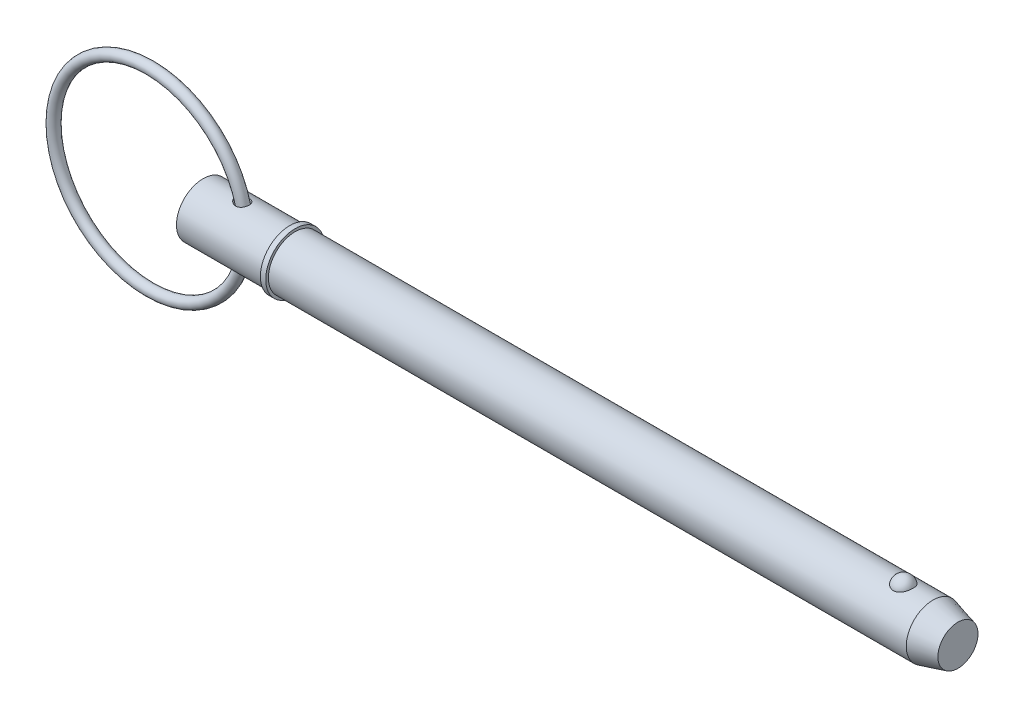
ISO-10303-21;
HEADER;
FILE_DESCRIPTION(('STEP AP214'),'2;1');
FILE_NAME('part.step','',(''),(''),'','','');
FILE_SCHEMA(('AUTOMOTIVE_DESIGN { 1 0 10303 214 1 1 1 1 }'));
ENDSEC;
DATA;
#1=APPLICATION_CONTEXT('core data for automotive mechanical design processes');
#2=APPLICATION_PROTOCOL_DEFINITION('international standard','automotive_design',2000,#1);
#3=PRODUCT_CONTEXT('',#1,'mechanical');
#4=PRODUCT('Part','Part','',(#3));
#5=PRODUCT_RELATED_PRODUCT_CATEGORY('part','',(#4));
#6=PRODUCT_DEFINITION_FORMATION('','',#4);
#7=PRODUCT_DEFINITION_CONTEXT('part definition',#1,'design');
#8=PRODUCT_DEFINITION('design','',#6,#7);
#9=PRODUCT_DEFINITION_SHAPE('','',#8);
#10=(LENGTH_UNIT() NAMED_UNIT(*) SI_UNIT(.MILLI.,.METRE.));
#11=(NAMED_UNIT(*) PLANE_ANGLE_UNIT() SI_UNIT($,.RADIAN.));
#12=(NAMED_UNIT(*) SI_UNIT($,.STERADIAN.) SOLID_ANGLE_UNIT());
#13=UNCERTAINTY_MEASURE_WITH_UNIT(LENGTH_MEASURE(1.E-05),#10,'distance_accuracy_value','');
#14=(GEOMETRIC_REPRESENTATION_CONTEXT(3) GLOBAL_UNCERTAINTY_ASSIGNED_CONTEXT((#13)) GLOBAL_UNIT_ASSIGNED_CONTEXT((#10,
#11,#12)) REPRESENTATION_CONTEXT('',''));
#15=CARTESIAN_POINT('',(0.,0.,0.));
#16=DIRECTION('',(0.,0.,1.));
#17=DIRECTION('',(1.,0.,0.));
#18=AXIS2_PLACEMENT_3D('',#15,#16,#17);
#19=CARTESIAN_POINT('',(-15.855506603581,0.,0.));
#20=DIRECTION('',(0.,0.,1.));
#21=DIRECTION('',(1.,0.,0.));
#22=AXIS2_PLACEMENT_3D('',#19,#20,#21);
#23=TOROIDAL_SURFACE('',#22,28.575,1.588);
#24=CARTESIAN_POINT('',(14.307493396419,0.,0.));
#25=VERTEX_POINT('',#24);
#26=VERTEX_LOOP('',#25);
#27=FACE_BOUND('',#26,.T.);
#28=ADVANCED_FACE('P0_F12',(#27),#23,.T.);
#29=CLOSED_SHELL('',(#28));
#30=MANIFOLD_SOLID_BREP('P0_B1',#29);
#31=CARTESIAN_POINT('',(0.,0.,0.));
#32=DIRECTION('',(1.,0.,0.));
#33=DIRECTION('',(0.,0.,-1.));
#34=AXIS2_PLACEMENT_3D('',#31,#32,#33);
#35=CYLINDRICAL_SURFACE('',#34,7.94);
#36=CARTESIAN_POINT('',(9.9064878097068,7.8609270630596,-1.11777712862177));
#37=CARTESIAN_POINT('',(9.98046148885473,7.84701054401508,-1.21564239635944));
#38=CARTESIAN_POINT('',(10.0632949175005,7.83217804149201,-1.30680329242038));
#39=CARTESIAN_POINT('',(10.243327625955,7.80247884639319,-1.47382688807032));
#40=CARTESIAN_POINT('',(10.3405572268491,7.78761214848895,-1.54965647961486));
#41=CARTESIAN_POINT('',(10.5460150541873,7.75960959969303,-1.6842723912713));
#42=CARTESIAN_POINT('',(10.654212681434,7.74646915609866,-1.74310445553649));
#43=CARTESIAN_POINT('',(10.8789333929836,7.72340979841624,-1.84259563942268));
#44=CARTESIAN_POINT('',(10.9954527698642,7.71348946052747,-1.88326279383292));
#45=CARTESIAN_POINT('',(11.2371543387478,7.69793327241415,-1.94589519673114));
#46=CARTESIAN_POINT('',(11.3624861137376,7.69242163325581,-1.96732022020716));
#47=CARTESIAN_POINT('',(11.6151110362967,7.68708151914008,-1.98809161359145));
#48=CARTESIAN_POINT('',(11.7424035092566,7.68725113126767,-1.98744541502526));
#49=CARTESIAN_POINT('',(11.9871377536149,7.69329740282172,-1.96389977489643));
#50=CARTESIAN_POINT('',(12.1047148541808,7.69883374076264,-1.94232728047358));
#51=CARTESIAN_POINT('',(12.3339179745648,7.7145667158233,-1.87886184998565));
#52=CARTESIAN_POINT('',(12.4455463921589,7.72476145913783,-1.83697717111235));
#53=CARTESIAN_POINT('',(12.6521036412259,7.74778151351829,-1.73721211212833));
#54=CARTESIAN_POINT('',(12.7476463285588,7.76039274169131,-1.68054854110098));
#55=CARTESIAN_POINT('',(12.9274536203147,7.78715828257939,-1.55179691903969));
#56=CARTESIAN_POINT('',(13.0117191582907,7.80131246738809,-1.47971014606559));
#57=CARTESIAN_POINT('',(13.16544092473,7.82932755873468,-1.32341211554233));
#58=CARTESIAN_POINT('',(13.2351086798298,7.84318958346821,-1.23940873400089));
#59=CARTESIAN_POINT('',(13.3595610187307,7.86933512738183,-1.06080152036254));
#60=CARTESIAN_POINT('',(13.4143450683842,7.88161858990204,-0.966197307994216));
#61=CARTESIAN_POINT('',(13.5082288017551,7.90340571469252,-0.767990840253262));
#62=CARTESIAN_POINT('',(13.5471601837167,7.91287927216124,-0.664305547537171));
#63=CARTESIAN_POINT('',(13.6076213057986,7.92785679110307,-0.451705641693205));
#64=CARTESIAN_POINT('',(13.6291504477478,7.93336061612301,-0.3427908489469));
#65=CARTESIAN_POINT('',(13.6544025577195,7.93983472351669,-0.122042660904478));
#66=CARTESIAN_POINT('',(13.6580055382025,7.94077445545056,-0.0101946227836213));
#67=CARTESIAN_POINT('',(13.6469977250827,7.93793630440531,0.212542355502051));
#68=CARTESIAN_POINT('',(13.6323866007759,7.93415833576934,0.323431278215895));
#69=CARTESIAN_POINT('',(13.5852649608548,7.92228583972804,0.541194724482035));
#70=CARTESIAN_POINT('',(13.5527398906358,7.91418780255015,0.648065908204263));
#71=CARTESIAN_POINT('',(13.4705326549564,7.8945509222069,0.854658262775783));
#72=CARTESIAN_POINT('',(13.4208502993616,7.88301204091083,0.954379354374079));
#73=CARTESIAN_POINT('',(13.3056021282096,7.85778224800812,1.14366619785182));
#74=CARTESIAN_POINT('',(13.2400609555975,7.8440946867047,1.23324739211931));
#75=CARTESIAN_POINT('',(13.0946981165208,7.8160855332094,1.39984119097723));
#76=CARTESIAN_POINT('',(13.0148777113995,7.80176399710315,1.47685490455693));
#77=CARTESIAN_POINT('',(12.8438529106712,7.774237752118,1.6154855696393));
#78=CARTESIAN_POINT('',(12.7527554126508,7.76102428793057,1.67723263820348));
#79=CARTESIAN_POINT('',(12.5611987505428,7.73705789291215,1.78453696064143));
#80=CARTESIAN_POINT('',(12.4607407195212,7.72630466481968,1.83009617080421));
#81=CARTESIAN_POINT('',(12.2541997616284,7.70849465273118,1.90371822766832));
#82=CARTESIAN_POINT('',(12.1481665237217,7.7014098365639,1.93191408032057));
#83=CARTESIAN_POINT('',(11.9327851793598,7.69148605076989,1.97105353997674));
#84=CARTESIAN_POINT('',(11.8234367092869,7.68864754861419,1.98199524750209));
#85=CARTESIAN_POINT('',(11.6016024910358,7.68735890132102,1.98698770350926));
#86=CARTESIAN_POINT('',(11.4891069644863,7.68902083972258,1.98060702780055));
#87=CARTESIAN_POINT('',(11.2665484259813,7.6966276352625,1.95083303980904));
#88=CARTESIAN_POINT('',(11.1564861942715,7.70257384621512,1.92743434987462));
#89=CARTESIAN_POINT('',(10.9339966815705,7.71853798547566,1.86251478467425));
#90=CARTESIAN_POINT('',(10.8219140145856,7.72880438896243,1.81987394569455));
#91=CARTESIAN_POINT('',(10.6060441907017,7.75216432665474,1.7176403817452));
#92=CARTESIAN_POINT('',(10.5022611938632,7.76525926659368,1.65803922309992));
#93=CARTESIAN_POINT('',(10.3000447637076,7.79362794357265,1.51929354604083));
#94=CARTESIAN_POINT('',(10.2022480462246,7.80898310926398,1.4392327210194));
#95=CARTESIAN_POINT('',(10.0221668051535,7.83939672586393,1.26310118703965));
#96=CARTESIAN_POINT('',(9.93988168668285,7.85445518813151,1.16703109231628));
#97=CARTESIAN_POINT('',(9.79729823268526,7.88178950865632,0.964874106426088));
#98=CARTESIAN_POINT('',(9.73627994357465,7.89414970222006,0.859310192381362));
#99=CARTESIAN_POINT('',(9.63554001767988,7.91508909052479,0.638143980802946));
#100=CARTESIAN_POINT('',(9.59578986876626,7.92367334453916,0.52255536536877));
#101=CARTESIAN_POINT('',(9.54388714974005,7.93499161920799,0.300466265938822));
#102=CARTESIAN_POINT('',(9.52888458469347,7.93832727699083,0.194660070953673));
#103=CARTESIAN_POINT('',(9.51823078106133,7.94068976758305,-0.0179747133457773));
#104=CARTESIAN_POINT('',(9.52257317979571,7.93971801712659,-0.124802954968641));
#105=CARTESIAN_POINT('',(9.54911264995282,7.93386114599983,-0.326814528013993));
#106=CARTESIAN_POINT('',(9.56976509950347,7.92931471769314,-0.422217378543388));
#107=CARTESIAN_POINT('',(9.62591284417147,7.91721462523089,-0.608271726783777));
#108=CARTESIAN_POINT('',(9.66139801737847,7.90966301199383,-0.698926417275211));
#109=CARTESIAN_POINT('',(9.7317197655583,7.89515389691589,-0.844763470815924));
#110=CARTESIAN_POINT('',(9.76292633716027,7.88881879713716,-0.90180107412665));
#111=CARTESIAN_POINT('',(9.83075962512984,7.87538342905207,-1.01244242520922));
#112=CARTESIAN_POINT('',(9.86738597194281,7.86828321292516,-1.06604640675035));
#113=CARTESIAN_POINT('',(9.9064878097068,7.8609270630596,-1.11777712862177));
#114=B_SPLINE_CURVE_WITH_KNOTS('',3,(#36,#37,#38,#39,#40,#41,#42,#43,#44,#45,#46,#47,#48,#49,
#50,#51,#52,#53,#54,#55,#56,#57,#58,#59,#60,#61,#62,#63,#64,#65,#66,#67,#68,#69,#70,#71,#72,#73,
#74,#75,#76,#77,#78,#79,#80,#81,#82,#83,#84,#85,#86,#87,#88,#89,#90,#91,#92,#93,#94,#95,#96,#97,
#98,#99,#100,#101,#102,#103,#104,#105,#106,#107,#108,#109,#110,#111,#112,#113),.UNSPECIFIED.,
.T.,.F.,(4,2,2,2,2,2,2,2,2,2,2,2,2,2,2,2,2,2,2,2,2,2,2,2,2,2,2,2,2,2,2,2,2,2,2,2,2,2,4),(0.,
0.370138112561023,0.741067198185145,1.11098852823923,1.48074607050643,1.86058657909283,
2.24029919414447,2.59740885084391,2.95437345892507,3.2881332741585,3.62186544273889,
3.95036374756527,4.27887384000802,4.61078596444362,4.94270949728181,5.27685177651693,
5.61100012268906,5.94542035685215,6.27984429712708,6.61375187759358,6.94762997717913,
7.27855592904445,7.60944187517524,7.93776058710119,8.26611544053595,8.60272268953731,
8.93943635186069,9.29895306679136,9.65864886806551,10.0387340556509,10.4188046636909,
10.7843533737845,11.1494107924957,11.4683925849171,11.7872694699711,12.0791172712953,
12.3707662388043,12.5664313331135,12.7620830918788),.UNSPECIFIED.);
#115=CARTESIAN_POINT('',(9.9064878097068,7.8609270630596,-1.11777712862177));
#116=VERTEX_POINT('',#115);
#117=EDGE_CURVE('P1_E42',#116,#116,#114,.T.);
#118=ORIENTED_EDGE('',*,*,#117,.T.);
#119=EDGE_LOOP('',(#118));
#120=FACE_BOUND('',#119,.T.);
#121=CARTESIAN_POINT('',(0.,0.,0.));
#122=DIRECTION('',(1.,0.,0.));
#123=DIRECTION('',(0.,0.,-1.));
#124=AXIS2_PLACEMENT_3D('',#121,#122,#123);
#125=CIRCLE('',#124,7.94);
#126=CARTESIAN_POINT('',(0.,0.,-7.94));
#127=VERTEX_POINT('',#126);
#128=EDGE_CURVE('P1_E9',#127,#127,#125,.T.);
#129=ORIENTED_EDGE('',*,*,#128,.T.);
#130=EDGE_LOOP('',(#129));
#131=FACE_BOUND('',#130,.T.);
#132=CARTESIAN_POINT('',(25.722,0.,0.));
#133=DIRECTION('',(1.,0.,0.));
#134=DIRECTION('',(0.,0.,-1.));
#135=AXIS2_PLACEMENT_3D('',#132,#133,#134);
#136=CIRCLE('',#135,7.94);
#137=CARTESIAN_POINT('',(25.722,0.,-7.94));
#138=VERTEX_POINT('',#137);
#139=EDGE_CURVE('P1_E25',#138,#138,#136,.T.);
#140=ORIENTED_EDGE('',*,*,#139,.F.);
#141=EDGE_LOOP('',(#140));
#142=FACE_BOUND('',#141,.T.);
#143=CARTESIAN_POINT('',(9.9064878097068,-7.8609270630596,-1.11777712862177));
#144=CARTESIAN_POINT('',(9.84378768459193,-7.87272256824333,-1.03482250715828));
#145=CARTESIAN_POINT('',(9.7874122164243,-7.88386682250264,-0.947002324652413));
#146=CARTESIAN_POINT('',(9.68947008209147,-7.90377389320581,-0.763202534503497));
#147=CARTESIAN_POINT('',(9.64789384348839,-7.91253824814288,-0.667228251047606));
#148=CARTESIAN_POINT('',(9.58141396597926,-7.92676779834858,-0.46889851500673));
#149=CARTESIAN_POINT('',(9.55658638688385,-7.93221793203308,-0.36651622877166));
#150=CARTESIAN_POINT('',(9.525398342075,-7.9390896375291,-0.158837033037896));
#151=CARTESIAN_POINT('',(9.51903196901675,-7.94051249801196,-0.0535410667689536));
#152=CARTESIAN_POINT('',(9.5249639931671,-7.93919670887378,0.149856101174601));
#153=CARTESIAN_POINT('',(9.53611757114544,-7.9367132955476,0.24799461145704));
#154=CARTESIAN_POINT('',(9.57435037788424,-7.92833496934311,0.44094918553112));
#155=CARTESIAN_POINT('',(9.60143086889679,-7.92243978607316,0.535764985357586));
#156=CARTESIAN_POINT('',(9.67027872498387,-7.90782830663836,0.720026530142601));
#157=CARTESIAN_POINT('',(9.71210005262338,-7.89910165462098,0.809451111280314));
#158=CARTESIAN_POINT('',(9.80864905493,-7.87966534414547,0.980775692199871));
#159=CARTESIAN_POINT('',(9.86338092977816,-7.86895504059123,1.06267323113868));
#160=CARTESIAN_POINT('',(9.99009906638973,-7.84531573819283,1.22559225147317));
#161=CARTESIAN_POINT('',(10.0632770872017,-7.8322718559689,1.30566871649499));
#162=CARTESIAN_POINT('',(10.2208237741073,-7.80611237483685,1.45392159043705));
#163=CARTESIAN_POINT('',(10.3051986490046,-7.79299674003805,1.52209134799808));
#164=CARTESIAN_POINT('',(10.4935539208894,-7.76638841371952,1.65280871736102));
#165=CARTESIAN_POINT('',(10.5986730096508,-7.75303312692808,1.71374951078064));
#166=CARTESIAN_POINT('',(10.8175805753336,-7.72920597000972,1.81820073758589));
#167=CARTESIAN_POINT('',(10.9313721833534,-7.71873514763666,1.86170483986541));
#168=CARTESIAN_POINT('',(11.1696833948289,-7.70161777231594,1.93133079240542));
#169=CARTESIAN_POINT('',(11.2944525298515,-7.69514907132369,1.95665138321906));
#170=CARTESIAN_POINT('',(11.5466607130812,-7.6877908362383,1.98537345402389));
#171=CARTESIAN_POINT('',(11.6740986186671,-7.68689896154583,1.98878412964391));
#172=CARTESIAN_POINT('',(11.9206005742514,-7.690938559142,1.97309854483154));
#173=CARTESIAN_POINT('',(12.0397453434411,-7.69555832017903,1.95520713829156));
#174=CARTESIAN_POINT('',(12.2727177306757,-7.70968728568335,1.89872693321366));
#175=CARTESIAN_POINT('',(12.3865475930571,-7.71919440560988,1.86014695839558));
#176=CARTESIAN_POINT('',(12.5975118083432,-7.74115679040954,1.76641559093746));
#177=CARTESIAN_POINT('',(12.6952552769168,-7.75336701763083,1.71257254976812));
#178=CARTESIAN_POINT('',(12.8798510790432,-7.77962828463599,1.58901145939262));
#179=CARTESIAN_POINT('',(12.9667044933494,-7.79367914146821,1.51929498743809));
#180=CARTESIAN_POINT('',(13.1254818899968,-7.82172079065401,1.36751778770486));
#181=CARTESIAN_POINT('',(13.1976693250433,-7.83570718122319,1.28573131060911));
#182=CARTESIAN_POINT('',(13.3274495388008,-7.86236718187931,1.11111271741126));
#183=CARTESIAN_POINT('',(13.3850418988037,-7.87504075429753,1.01828028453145));
#184=CARTESIAN_POINT('',(13.4847470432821,-7.89782512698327,0.823214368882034));
#185=CARTESIAN_POINT('',(13.5267056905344,-7.90791011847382,0.72089908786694));
#186=CARTESIAN_POINT('',(13.5933891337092,-7.92427335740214,0.510509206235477));
#187=CARTESIAN_POINT('',(13.6181132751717,-7.9305514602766,0.40243438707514));
#188=CARTESIAN_POINT('',(13.6498843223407,-7.93866355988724,0.182728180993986));
#189=CARTESIAN_POINT('',(13.6567982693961,-7.94046412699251,0.0710763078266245));
#190=CARTESIAN_POINT('',(13.6524060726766,-7.93933046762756,-0.151845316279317));
#191=CARTESIAN_POINT('',(13.6410996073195,-7.93639615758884,-0.263115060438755));
#192=CARTESIAN_POINT('',(13.6005023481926,-7.92610202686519,-0.482238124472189));
#193=CARTESIAN_POINT('',(13.571192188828,-7.91873744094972,-0.590087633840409));
#194=CARTESIAN_POINT('',(13.495246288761,-7.90037565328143,-0.799178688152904));
#195=CARTESIAN_POINT('',(13.4486102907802,-7.88937839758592,-0.900420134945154));
#196=CARTESIAN_POINT('',(13.3391817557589,-7.86497175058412,-1.09328280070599));
#197=CARTESIAN_POINT('',(13.2764083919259,-7.85156522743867,-1.18491525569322));
#198=CARTESIAN_POINT('',(13.1362355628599,-7.8238261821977,-1.35604994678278));
#199=CARTESIAN_POINT('',(13.0588372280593,-7.80949373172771,-1.43555311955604));
#200=CARTESIAN_POINT('',(12.8921392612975,-7.78164292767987,-1.57955181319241));
#201=CARTESIAN_POINT('',(12.8029410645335,-7.76811892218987,-1.64416363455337));
#202=CARTESIAN_POINT('',(12.6146622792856,-7.74328422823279,-1.75742016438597));
#203=CARTESIAN_POINT('',(12.5155829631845,-7.73197325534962,-1.80606692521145));
#204=CARTESIAN_POINT('',(12.31135301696,-7.71289290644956,-1.88588502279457));
#205=CARTESIAN_POINT('',(12.2062651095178,-7.70509254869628,-1.91720981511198));
#206=CARTESIAN_POINT('',(11.9922253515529,-7.69365188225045,-1.96261878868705));
#207=CARTESIAN_POINT('',(11.8832731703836,-7.69001193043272,-1.97670149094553));
#208=CARTESIAN_POINT('',(11.662174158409,-7.6871142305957,-1.98794112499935));
#209=CARTESIAN_POINT('',(11.5500082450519,-7.6879499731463,-1.98473694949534));
#210=CARTESIAN_POINT('',(11.3276038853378,-7.69396349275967,-1.96129119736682));
#211=CARTESIAN_POINT('',(11.2173659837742,-7.6991424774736,-1.94104488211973));
#212=CARTESIAN_POINT('',(10.9943151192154,-7.71363470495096,-1.8826578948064));
#213=CARTESIAN_POINT('',(10.8818004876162,-7.72319478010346,-1.8434396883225));
#214=CARTESIAN_POINT('',(10.6644693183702,-7.74534199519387,-1.74804607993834));
#215=CARTESIAN_POINT('',(10.5596578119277,-7.75793109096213,-1.69185971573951));
#216=CARTESIAN_POINT('',(10.3538333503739,-7.78563853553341,-1.55958016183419));
#217=CARTESIAN_POINT('',(10.2535123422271,-7.80086820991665,-1.48242881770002));
#218=CARTESIAN_POINT('',(10.0678634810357,-7.83136022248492,-1.31182139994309));
#219=CARTESIAN_POINT('',(9.98252491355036,-7.84662252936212,-1.21837707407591));
#220=CARTESIAN_POINT('',(9.9064878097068,-7.8609270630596,-1.11777712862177));
#221=B_SPLINE_CURVE_WITH_KNOTS('',3,(#143,#144,#145,#146,#147,#148,#149,#150,#151,#152,#153,
#154,#155,#156,#157,#158,#159,#160,#161,#162,#163,#164,#165,#166,#167,#168,#169,#170,#171,#172,
#173,#174,#175,#176,#177,#178,#179,#180,#181,#182,#183,#184,#185,#186,#187,#188,#189,#190,#191,
#192,#193,#194,#195,#196,#197,#198,#199,#200,#201,#202,#203,#204,#205,#206,#207,#208,#209,#210,
#211,#212,#213,#214,#215,#216,#217,#218,#219,#220),.UNSPECIFIED.,.T.,.F.,(4,2,2,2,2,2,2,2,2,2,2,
2,2,2,2,2,2,2,2,2,2,2,2,2,2,2,2,2,2,2,2,2,2,2,2,2,2,2,4),(0.,0.313593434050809,
0.626983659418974,0.941787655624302,1.25649090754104,1.55146990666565,1.84647228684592,
2.14256601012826,2.43875619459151,2.76521830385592,3.09186220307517,3.45696288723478,
3.82219601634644,4.20267276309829,4.58298981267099,4.94277962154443,5.30241610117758,
5.63754619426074,5.9726430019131,6.30104941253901,6.62946524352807,6.96103833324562,
7.29262401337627,7.62667800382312,7.96073789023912,8.29515773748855,8.62958255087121,
8.96361184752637,9.29761533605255,9.62891449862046,9.96017105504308,10.288443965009,
10.616745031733,10.951930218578,11.2872086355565,11.6442788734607,12.0015802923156,
12.3821516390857,12.762449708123),.UNSPECIFIED.);
#222=CARTESIAN_POINT('',(9.9064878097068,-7.8609270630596,-1.11777712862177));
#223=VERTEX_POINT('',#222);
#224=EDGE_CURVE('P1_E17',#223,#223,#221,.T.);
#225=ORIENTED_EDGE('',*,*,#224,.T.);
#226=EDGE_LOOP('',(#225));
#227=FACE_BOUND('',#226,.T.);
#228=ADVANCED_FACE('P1_F13',(#120,#131,#142,#227),#35,.T.);
#229=CARTESIAN_POINT('',(0.,0.,0.));
#230=DIRECTION('',(1.,0.,0.));
#231=DIRECTION('',(0.,0.,-1.));
#232=AXIS2_PLACEMENT_3D('',#229,#230,#231);
#233=CYLINDRICAL_SURFACE('',#232,7.94);
#234=CARTESIAN_POINT('',(216.751879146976,0.,0.));
#235=DIRECTION('',(1.,0.,0.));
#236=DIRECTION('',(0.,0.,-1.));
#237=AXIS2_PLACEMENT_3D('',#234,#235,#236);
#238=CIRCLE('',#237,7.94);
#239=CARTESIAN_POINT('',(216.751879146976,0.,-7.94));
#240=VERTEX_POINT('',#239);
#241=EDGE_CURVE('P1_E99',#240,#240,#238,.T.);
#242=ORIENTED_EDGE('',*,*,#241,.F.);
#243=EDGE_LOOP('',(#242));
#244=FACE_BOUND('',#243,.T.);
#245=CARTESIAN_POINT('',(27.31,0.,0.));
#246=DIRECTION('',(1.,0.,0.));
#247=DIRECTION('',(0.,0.,-1.));
#248=AXIS2_PLACEMENT_3D('',#245,#246,#247);
#249=CIRCLE('',#248,7.94);
#250=CARTESIAN_POINT('',(27.31,0.,-7.94));
#251=VERTEX_POINT('',#250);
#252=EDGE_CURVE('P1_E96',#251,#251,#249,.T.);
#253=ORIENTED_EDGE('',*,*,#252,.T.);
#254=EDGE_LOOP('',(#253));
#255=FACE_BOUND('',#254,.T.);
#256=CARTESIAN_POINT('',(207.944907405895,7.37767842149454,2.93486986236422));
#257=CARTESIAN_POINT('',(207.792749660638,7.3776732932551,2.93487505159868));
#258=CARTESIAN_POINT('',(207.640632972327,7.38258419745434,2.92262454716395));
#259=CARTESIAN_POINT('',(207.340928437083,7.40163229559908,2.87404196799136));
#260=CARTESIAN_POINT('',(207.193339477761,7.41576720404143,2.83771585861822));
#261=CARTESIAN_POINT('',(206.907018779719,7.45161576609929,2.74218769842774));
#262=CARTESIAN_POINT('',(206.768274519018,7.47331841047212,2.68301886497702));
#263=CARTESIAN_POINT('',(206.502882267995,7.52194082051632,2.54350967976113));
#264=CARTESIAN_POINT('',(206.376236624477,7.54886159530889,2.46316523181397));
#265=CARTESIAN_POINT('',(206.134534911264,7.60594671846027,2.28090375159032));
#266=CARTESIAN_POINT('',(206.019906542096,7.63618114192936,2.1784421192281));
#267=CARTESIAN_POINT('',(205.808878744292,7.69614046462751,1.95608495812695));
#268=CARTESIAN_POINT('',(205.712482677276,7.72586526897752,1.83618622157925));
#269=CARTESIAN_POINT('',(205.535938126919,7.78314821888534,1.57628086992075));
#270=CARTESIAN_POINT('',(205.456707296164,7.81055035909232,1.43561546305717));
#271=CARTESIAN_POINT('',(205.321797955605,7.85879631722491,1.142363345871));
#272=CARTESIAN_POINT('',(205.266121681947,7.87963951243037,0.989775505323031));
#273=CARTESIAN_POINT('',(205.17881215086,7.91289645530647,0.674619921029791));
#274=CARTESIAN_POINT('',(205.14753090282,7.92518652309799,0.511941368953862));
#275=CARTESIAN_POINT('',(205.110975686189,7.93958930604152,0.183247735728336));
#276=CARTESIAN_POINT('',(205.105701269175,7.94170219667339,0.0172327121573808));
#277=CARTESIAN_POINT('',(205.121231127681,7.93554931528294,-0.312672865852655));
#278=CARTESIAN_POINT('',(205.141925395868,7.92732732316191,-0.476569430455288));
#279=CARTESIAN_POINT('',(205.20878655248,7.90141534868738,-0.798305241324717));
#280=CARTESIAN_POINT('',(205.254953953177,7.88372517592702,-0.956144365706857));
#281=CARTESIAN_POINT('',(205.371898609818,7.84066230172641,-1.26152073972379));
#282=CARTESIAN_POINT('',(205.442704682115,7.81528060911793,-1.40904568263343));
#283=CARTESIAN_POINT('',(205.607478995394,7.75948672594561,-1.68950598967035));
#284=CARTESIAN_POINT('',(205.701448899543,7.72907417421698,-1.82244030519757));
#285=CARTESIAN_POINT('',(205.910839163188,7.66640424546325,-2.07032792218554));
#286=CARTESIAN_POINT('',(206.026315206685,7.63414223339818,-2.18523308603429));
#287=CARTESIAN_POINT('',(206.2759006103,7.57149681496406,-2.39329737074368));
#288=CARTESIAN_POINT('',(206.410008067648,7.54111321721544,-2.48645870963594));
#289=CARTESIAN_POINT('',(206.690111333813,7.48650742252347,-2.64628132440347));
#290=CARTESIAN_POINT('',(206.835760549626,7.46215900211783,-2.71350554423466));
#291=CARTESIAN_POINT('',(207.137425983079,7.42171253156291,-2.82226614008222));
#292=CARTESIAN_POINT('',(207.293438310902,7.40561140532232,-2.86381209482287));
#293=CARTESIAN_POINT('',(207.602970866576,7.3842679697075,-2.9183907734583));
#294=CARTESIAN_POINT('',(207.756222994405,7.37852109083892,-2.93275024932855));
#295=CARTESIAN_POINT('',(208.063070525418,7.37700973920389,-2.93655208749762));
#296=CARTESIAN_POINT('',(208.216665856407,7.38124333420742,-2.92599927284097));
#297=CARTESIAN_POINT('',(208.514990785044,7.39890635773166,-2.88102897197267));
#298=CARTESIAN_POINT('',(208.659848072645,7.41205491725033,-2.84733999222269));
#299=CARTESIAN_POINT('',(208.94164329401,7.445801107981,-2.75788206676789));
#300=CARTESIAN_POINT('',(209.078580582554,7.46639934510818,-2.70211132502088));
#301=CARTESIAN_POINT('',(209.344061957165,7.51339098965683,-2.56858908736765));
#302=CARTESIAN_POINT('',(209.472354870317,7.53990200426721,-2.4903806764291));
#303=CARTESIAN_POINT('',(209.714244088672,7.59569503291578,-2.31462737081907));
#304=CARTESIAN_POINT('',(209.827837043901,7.6249776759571,-2.21707808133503));
#305=CARTESIAN_POINT('',(210.04322156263,7.68489473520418,-1.99982049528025));
#306=CARTESIAN_POINT('',(210.144148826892,7.71552419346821,-1.87925337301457));
#307=CARTESIAN_POINT('',(210.325186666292,7.77353016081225,-1.6226882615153));
#308=CARTESIAN_POINT('',(210.405293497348,7.80090608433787,-1.48668750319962));
#309=CARTESIAN_POINT('',(210.545361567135,7.85047992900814,-1.1981841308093));
#310=CARTESIAN_POINT('',(210.604587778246,7.8724818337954,-1.04529016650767));
#311=CARTESIAN_POINT('',(210.697982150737,7.90785114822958,-0.731080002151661));
#312=CARTESIAN_POINT('',(210.732149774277,7.92121837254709,-0.569763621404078));
#313=CARTESIAN_POINT('',(210.774795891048,7.93797834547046,-0.242812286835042));
#314=CARTESIAN_POINT('',(210.783204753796,7.94134405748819,-0.0771668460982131));
#315=CARTESIAN_POINT('',(210.773962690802,7.93767937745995,0.253276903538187));
#316=CARTESIAN_POINT('',(210.756312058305,7.93064910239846,0.418075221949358));
#317=CARTESIAN_POINT('',(210.695424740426,7.90695571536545,0.741525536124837));
#318=CARTESIAN_POINT('',(210.652281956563,7.8903279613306,0.900197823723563));
#319=CARTESIAN_POINT('',(210.54135358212,7.84916386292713,1.20759654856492));
#320=CARTESIAN_POINT('',(210.47356656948,7.82462706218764,1.35632241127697));
#321=CARTESIAN_POINT('',(210.314371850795,7.7700669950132,1.64032869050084));
#322=CARTESIAN_POINT('',(210.222861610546,7.74002008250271,1.7755471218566));
#323=CARTESIAN_POINT('',(210.018296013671,7.67774175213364,2.0280064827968));
#324=CARTESIAN_POINT('',(209.905241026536,7.64551037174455,2.14524772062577));
#325=CARTESIAN_POINT('',(209.660831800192,7.58265895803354,2.35778002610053));
#326=CARTESIAN_POINT('',(209.529583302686,7.5520309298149,2.45319004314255));
#327=CARTESIAN_POINT('',(209.251601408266,7.49579792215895,2.61999897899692));
#328=CARTESIAN_POINT('',(209.104867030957,7.4701932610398,2.69139637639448));
#329=CARTESIAN_POINT('',(208.792947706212,7.42622216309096,2.8105324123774));
#330=CARTESIAN_POINT('',(208.627220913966,7.40825002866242,2.85700910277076));
#331=CARTESIAN_POINT('',(208.289279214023,7.38398348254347,2.9191685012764));
#332=CARTESIAN_POINT('',(208.11706702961,7.3776842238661,2.93486399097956));
#333=CARTESIAN_POINT('',(207.944907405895,7.37767842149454,2.93486986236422));
#334=B_SPLINE_CURVE_WITH_KNOTS('',3,(#256,#257,#258,#259,#260,#261,#262,#263,#264,#265,#266,
#267,#268,#269,#270,#271,#272,#273,#274,#275,#276,#277,#278,#279,#280,#281,#282,#283,#284,#285,
#286,#287,#288,#289,#290,#291,#292,#293,#294,#295,#296,#297,#298,#299,#300,#301,#302,#303,#304,
#305,#306,#307,#308,#309,#310,#311,#312,#313,#314,#315,#316,#317,#318,#319,#320,#321,#322,#323,
#324,#325,#326,#327,#328,#329,#330,#331,#332,#333),.UNSPECIFIED.,.T.,.F.,(4,2,2,2,2,2,2,2,2,2,2,
2,2,2,2,2,2,2,2,2,2,2,2,2,2,2,2,2,2,2,2,2,2,2,2,2,2,2,4),(0.,0.455841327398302,
0.911569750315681,1.36663794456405,1.82179423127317,2.2897898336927,2.75787163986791,
3.24685368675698,3.73588214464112,4.23184282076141,4.72779494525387,5.22165321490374,
5.71552141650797,6.20996917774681,6.70445245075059,7.20023431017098,7.6959655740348,
8.18023418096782,8.66432203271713,9.1241069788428,9.58380291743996,10.0296503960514,
10.4755341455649,10.9312349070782,11.3870393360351,11.8654416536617,12.3439299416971,
12.8378875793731,13.3318558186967,13.8271581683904,14.3224549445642,14.8159385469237,
15.3094506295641,15.8051323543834,16.3008055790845,16.7937101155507,17.2866458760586,
17.8026240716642,18.3183879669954),.UNSPECIFIED.);
#335=CARTESIAN_POINT('',(207.944907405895,7.37767842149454,2.93486986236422));
#336=VERTEX_POINT('',#335);
#337=EDGE_CURVE('P1_E34',#336,#336,#334,.T.);
#338=ORIENTED_EDGE('',*,*,#337,.T.);
#339=EDGE_LOOP('',(#338));
#340=FACE_BOUND('',#339,.T.);
#341=ADVANCED_FACE('P1_F46',(#244,#255,#340),#233,.T.);
#342=CARTESIAN_POINT('',(0.,0.,0.));
#343=DIRECTION('',(-1.,0.,0.));
#344=DIRECTION('',(0.,0.,1.));
#345=AXIS2_PLACEMENT_3D('',#342,#343,#344);
#346=PLANE('',#345);
#347=ORIENTED_EDGE('',*,*,#128,.F.);
#348=EDGE_LOOP('',(#347));
#349=FACE_BOUND('',#348,.T.);
#350=ADVANCED_FACE('P1_F15',(#349),#346,.T.);
#351=CARTESIAN_POINT('',(25.722,7.94,0.));
#352=DIRECTION('',(-1.,0.,0.));
#353=DIRECTION('',(0.,0.,1.));
#354=AXIS2_PLACEMENT_3D('',#351,#352,#353);
#355=PLANE('',#354);
#356=ORIENTED_EDGE('',*,*,#139,.T.);
#357=EDGE_LOOP('',(#356));
#358=FACE_BOUND('',#357,.T.);
#359=CARTESIAN_POINT('',(25.722,0.,0.));
#360=DIRECTION('',(1.,0.,0.));
#361=DIRECTION('',(0.,0.,-1.));
#362=AXIS2_PLACEMENT_3D('',#359,#360,#361);
#363=CIRCLE('',#362,8.734);
#364=CARTESIAN_POINT('',(25.722,0.,-8.734));
#365=VERTEX_POINT('',#364);
#366=EDGE_CURVE('P1_E30',#365,#365,#363,.T.);
#367=ORIENTED_EDGE('',*,*,#366,.F.);
#368=EDGE_LOOP('',(#367));
#369=FACE_BOUND('',#368,.T.);
#370=ADVANCED_FACE('P1_F81',(#358,#369),#355,.T.);
#371=CARTESIAN_POINT('',(0.,0.,0.));
#372=DIRECTION('',(1.,0.,0.));
#373=DIRECTION('',(0.,0.,-1.));
#374=AXIS2_PLACEMENT_3D('',#371,#372,#373);
#375=CYLINDRICAL_SURFACE('',#374,8.734);
#376=ORIENTED_EDGE('',*,*,#366,.T.);
#377=EDGE_LOOP('',(#376));
#378=FACE_BOUND('',#377,.T.);
#379=CARTESIAN_POINT('',(27.31,0.,0.));
#380=DIRECTION('',(1.,0.,0.));
#381=DIRECTION('',(0.,0.,-1.));
#382=AXIS2_PLACEMENT_3D('',#379,#380,#381);
#383=CIRCLE('',#382,8.734);
#384=CARTESIAN_POINT('',(27.31,0.,-8.734));
#385=VERTEX_POINT('',#384);
#386=EDGE_CURVE('P1_E95',#385,#385,#383,.T.);
#387=ORIENTED_EDGE('',*,*,#386,.F.);
#388=EDGE_LOOP('',(#387));
#389=FACE_BOUND('',#388,.T.);
#390=ADVANCED_FACE('P1_F68',(#378,#389),#375,.T.);
#391=CARTESIAN_POINT('',(27.31,8.734,0.));
#392=DIRECTION('',(1.,0.,0.));
#393=DIRECTION('',(0.,0.,-1.));
#394=AXIS2_PLACEMENT_3D('',#391,#392,#393);
#395=PLANE('',#394);
#396=ORIENTED_EDGE('',*,*,#386,.T.);
#397=EDGE_LOOP('',(#396));
#398=FACE_BOUND('',#397,.T.);
#399=ORIENTED_EDGE('',*,*,#252,.F.);
#400=EDGE_LOOP('',(#399));
#401=FACE_BOUND('',#400,.T.);
#402=ADVANCED_FACE('P1_F62',(#398,#401),#395,.T.);
#403=CARTESIAN_POINT('',(224.16,0.,0.));
#404=DIRECTION('',(-1.,0.,0.));
#405=DIRECTION('',(0.,0.,1.));
#406=AXIS2_PLACEMENT_3D('',#403,#404,#405);
#407=CONICAL_SURFACE('',#406,5.95500000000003,0.261799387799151);
#408=ORIENTED_EDGE('',*,*,#241,.T.);
#409=EDGE_LOOP('',(#408));
#410=FACE_BOUND('',#409,.T.);
#411=CARTESIAN_POINT('',(224.16,0.,0.));
#412=DIRECTION('',(1.,0.,0.));
#413=DIRECTION('',(0.,0.,-1.));
#414=AXIS2_PLACEMENT_3D('',#411,#412,#413);
#415=CIRCLE('',#414,5.95500000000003);
#416=CARTESIAN_POINT('',(224.16,0.,-5.95500000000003));
#417=VERTEX_POINT('',#416);
#418=EDGE_CURVE('P1_E41',#417,#417,#415,.T.);
#419=ORIENTED_EDGE('',*,*,#418,.F.);
#420=EDGE_LOOP('',(#419));
#421=FACE_BOUND('',#420,.T.);
#422=ADVANCED_FACE('P1_F59',(#410,#421),#407,.T.);
#423=CARTESIAN_POINT('',(224.16,5.95500000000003,0.));
#424=DIRECTION('',(1.,0.,0.));
#425=DIRECTION('',(0.,0.,-1.));
#426=AXIS2_PLACEMENT_3D('',#423,#424,#425);
#427=PLANE('',#426);
#428=ORIENTED_EDGE('',*,*,#418,.T.);
#429=EDGE_LOOP('',(#428));
#430=FACE_BOUND('',#429,.T.);
#431=ADVANCED_FACE('P1_F55',(#430),#427,.T.);
#432=CARTESIAN_POINT('',(207.944907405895,7.14599999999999,0.));
#433=DIRECTION('',(-1.,0.,0.));
#434=DIRECTION('',(0.,-1.,0.));
#435=AXIS2_PLACEMENT_3D('',#432,#433,#434);
#436=SPHERICAL_SURFACE('',#435,2.944);
#437=ORIENTED_EDGE('',*,*,#337,.F.);
#438=EDGE_LOOP('',(#437));
#439=FACE_BOUND('',#438,.T.);
#440=ADVANCED_FACE('P1_F50',(#439),#436,.T.);
#441=CARTESIAN_POINT('',(-15.855506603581,0.,0.));
#442=DIRECTION('',(0.,0.,1.));
#443=DIRECTION('',(1.,0.,0.));
#444=AXIS2_PLACEMENT_3D('',#441,#442,#443);
#445=TOROIDAL_SURFACE('',#444,28.575,1.985);
#446=ORIENTED_EDGE('',*,*,#224,.F.);
#447=EDGE_LOOP('',(#446));
#448=FACE_BOUND('',#447,.T.);
#449=ORIENTED_EDGE('',*,*,#117,.F.);
#450=EDGE_LOOP('',(#449));
#451=FACE_BOUND('',#450,.T.);
#452=ADVANCED_FACE('P1_F54',(#448,#451),#445,.F.);
#453=CLOSED_SHELL('',(#228,#341,#350,#370,#390,#402,#422,#431,#440,#452));
#454=MANIFOLD_SOLID_BREP('P1_B1',#453);
#455=ADVANCED_BREP_SHAPE_REPRESENTATION('',(#18,#30,#454),#14);
#456=SHAPE_DEFINITION_REPRESENTATION(#9,#455);
ENDSEC;
END-ISO-10303-21;
